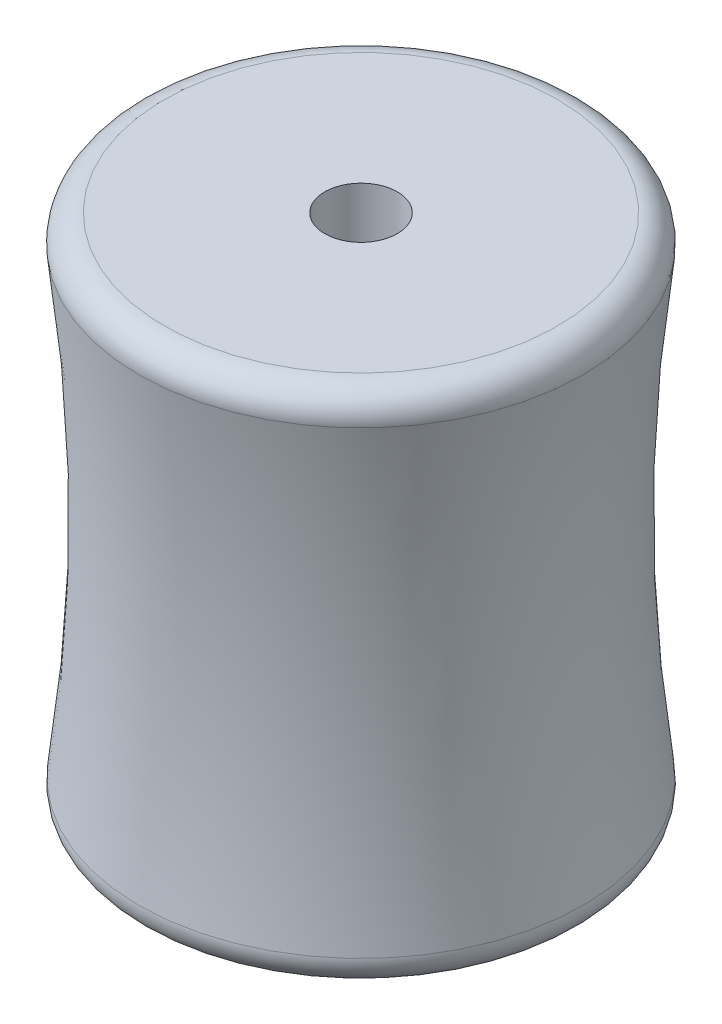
from build123d import *

# Parameters (mm, degrees)
FILLET1_R = 3


with BuildPart() as part:
    # Sketch3 → Revolve1 (revolve)
    with BuildSketch(Plane(origin=(0, 0, 0), x_dir=(0, 0, -1), z_dir=(1, 0, 0)), mode=Mode.PRIVATE) as revolve1_sk:
        with BuildLine():
            Line((-4, 0), (18, 0))
            ThreePointArc((18, 0), (15.737199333, 30), (18, 60))
            Line((18, 60), (-4, 60))
            Line((-4, 60), (-4, 0))
        make_face()
    revolve(revolve1_sk.sketch.rotate(Axis((0, 60, 8.2), (0, -1, 0)), 180), axis=Axis((0, 60, 8.2), (0, -1, 0)))

    # Fillet1
    fillet1_edges = [part.edges().sort_by_distance(p)[0] for p in [
        (0, 60, -18),
        (0, 0, -18),
    ]]
    fillet(fillet1_edges, radius=FILLET1_R)


solid = part.part
